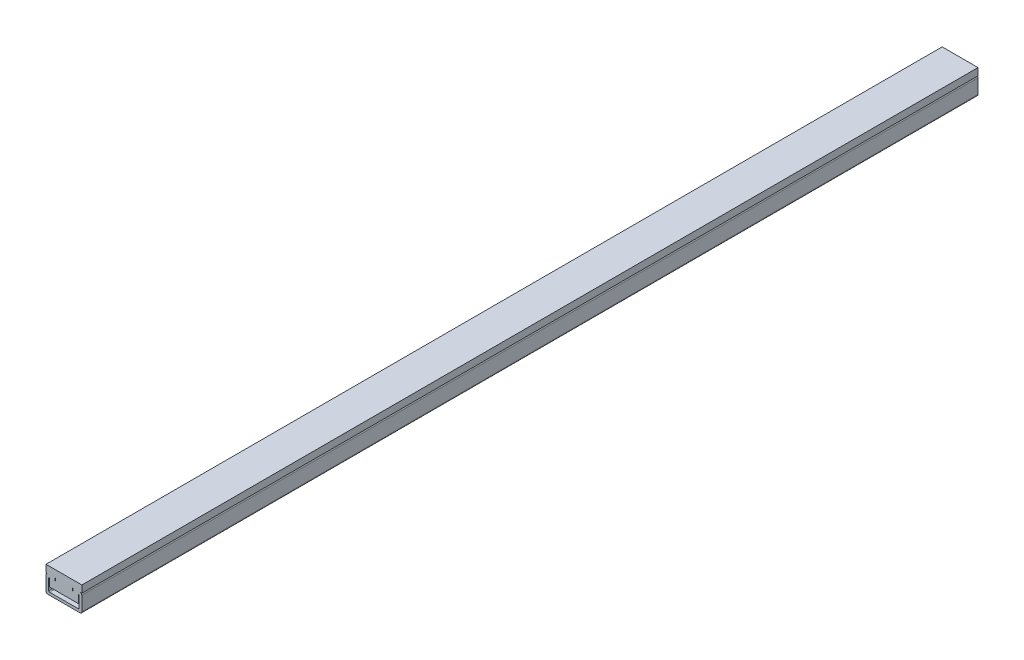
ISO-10303-21;
HEADER;
FILE_DESCRIPTION(('STEP AP214'),'2;1');
FILE_NAME('part.step','',(''),(''),'','','');
FILE_SCHEMA(('AUTOMOTIVE_DESIGN { 1 0 10303 214 1 1 1 1 }'));
ENDSEC;
DATA;
#1=APPLICATION_CONTEXT('core data for automotive mechanical design processes');
#2=APPLICATION_PROTOCOL_DEFINITION('international standard','automotive_design',2000,#1);
#3=PRODUCT_CONTEXT('',#1,'mechanical');
#4=PRODUCT('Part','Part','',(#3));
#5=PRODUCT_RELATED_PRODUCT_CATEGORY('part','',(#4));
#6=PRODUCT_DEFINITION_FORMATION('','',#4);
#7=PRODUCT_DEFINITION_CONTEXT('part definition',#1,'design');
#8=PRODUCT_DEFINITION('design','',#6,#7);
#9=PRODUCT_DEFINITION_SHAPE('','',#8);
#10=(LENGTH_UNIT() NAMED_UNIT(*) SI_UNIT(.MILLI.,.METRE.));
#11=(NAMED_UNIT(*) PLANE_ANGLE_UNIT() SI_UNIT($,.RADIAN.));
#12=(NAMED_UNIT(*) SI_UNIT($,.STERADIAN.) SOLID_ANGLE_UNIT());
#13=UNCERTAINTY_MEASURE_WITH_UNIT(LENGTH_MEASURE(1.E-05),#10,'distance_accuracy_value','');
#14=(GEOMETRIC_REPRESENTATION_CONTEXT(3) GLOBAL_UNCERTAINTY_ASSIGNED_CONTEXT((#13)) GLOBAL_UNIT_ASSIGNED_CONTEXT((#10,
#11,#12)) REPRESENTATION_CONTEXT('',''));
#15=CARTESIAN_POINT('',(0.,0.,0.));
#16=DIRECTION('',(0.,0.,1.));
#17=DIRECTION('',(1.,0.,0.));
#18=AXIS2_PLACEMENT_3D('',#15,#16,#17);
#19=CARTESIAN_POINT('',(9.,1.,0.));
#20=DIRECTION('',(0.,0.,1.));
#21=DIRECTION('',(1.,0.,0.));
#22=AXIS2_PLACEMENT_3D('',#19,#20,#21);
#23=PLANE('',#22);
#24=DIRECTION('',(0.,-1.,0.));
#25=VECTOR('',#24,1.);
#26=CARTESIAN_POINT('',(-4.75,10.,0.));
#27=LINE('',#26,#25);
#28=CARTESIAN_POINT('',(-4.75,10.,0.));
#29=VERTEX_POINT('',#28);
#30=CARTESIAN_POINT('',(-4.75,8.50000000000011,0.));
#31=VERTEX_POINT('',#30);
#32=EDGE_CURVE('E239',#29,#31,#27,.T.);
#33=ORIENTED_EDGE('',*,*,#32,.F.);
#34=DIRECTION('',(-1.,0.,0.));
#35=VECTOR('',#34,1.);
#36=CARTESIAN_POINT('',(-4.75,10.,0.));
#37=LINE('',#36,#35);
#38=CARTESIAN_POINT('',(-5.,10.,0.));
#39=VERTEX_POINT('',#38);
#40=EDGE_CURVE('E230',#29,#39,#37,.T.);
#41=ORIENTED_EDGE('',*,*,#40,.T.);
#42=DIRECTION('',(0.,-1.,0.));
#43=VECTOR('',#42,1.);
#44=CARTESIAN_POINT('',(-5.,10.,0.));
#45=LINE('',#44,#43);
#46=CARTESIAN_POINT('',(-5.,8.50000000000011,0.));
#47=VERTEX_POINT('',#46);
#48=EDGE_CURVE('E236',#39,#47,#45,.T.);
#49=ORIENTED_EDGE('',*,*,#48,.T.);
#50=DIRECTION('',(-1.,0.,0.));
#51=VECTOR('',#50,1.);
#52=CARTESIAN_POINT('',(-4.75,8.50000000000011,0.));
#53=LINE('',#52,#51);
#54=EDGE_CURVE('E29',#31,#47,#53,.T.);
#55=ORIENTED_EDGE('',*,*,#54,.F.);
#56=EDGE_LOOP('',(#33,#41,#49,#55));
#57=FACE_BOUND('',#56,.T.);
#58=DIRECTION('',(-1.,0.,0.));
#59=VECTOR('',#58,1.);
#60=CARTESIAN_POINT('',(5.,10.,0.));
#61=LINE('',#60,#59);
#62=CARTESIAN_POINT('',(5.,10.,0.));
#63=VERTEX_POINT('',#62);
#64=CARTESIAN_POINT('',(4.75,10.,0.));
#65=VERTEX_POINT('',#64);
#66=EDGE_CURVE('E265',#63,#65,#61,.T.);
#67=ORIENTED_EDGE('',*,*,#66,.T.);
#68=DIRECTION('',(0.,-1.,0.));
#69=VECTOR('',#68,1.);
#70=CARTESIAN_POINT('',(4.75,10.,0.));
#71=LINE('',#70,#69);
#72=CARTESIAN_POINT('',(4.75,8.50000000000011,0.));
#73=VERTEX_POINT('',#72);
#74=EDGE_CURVE('E257',#65,#73,#71,.T.);
#75=ORIENTED_EDGE('',*,*,#74,.T.);
#76=DIRECTION('',(-1.,0.,0.));
#77=VECTOR('',#76,1.);
#78=CARTESIAN_POINT('',(5.,8.50000000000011,0.));
#79=LINE('',#78,#77);
#80=CARTESIAN_POINT('',(5.,8.50000000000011,0.));
#81=VERTEX_POINT('',#80);
#82=EDGE_CURVE('E260',#81,#73,#79,.T.);
#83=ORIENTED_EDGE('',*,*,#82,.F.);
#84=DIRECTION('',(0.,-1.,0.));
#85=VECTOR('',#84,1.);
#86=CARTESIAN_POINT('',(5.,10.,0.));
#87=LINE('',#86,#85);
#88=EDGE_CURVE('E263',#63,#81,#87,.T.);
#89=ORIENTED_EDGE('',*,*,#88,.F.);
#90=EDGE_LOOP('',(#67,#75,#83,#89));
#91=FACE_BOUND('',#90,.T.);
#92=CARTESIAN_POINT('',(9.,1.,0.));
#93=DIRECTION('',(0.,0.,1.));
#94=DIRECTION('',(1.,0.,0.));
#95=AXIS2_PLACEMENT_3D('',#92,#93,#94);
#96=CIRCLE('',#95,1.);
#97=CARTESIAN_POINT('',(9.,0.,0.));
#98=VERTEX_POINT('',#97);
#99=CARTESIAN_POINT('',(10.,1.,0.));
#100=VERTEX_POINT('',#99);
#101=EDGE_CURVE('E394',#98,#100,#96,.T.);
#102=ORIENTED_EDGE('',*,*,#101,.F.);
#103=DIRECTION('',(-1.,0.,0.));
#104=VECTOR('',#103,1.);
#105=CARTESIAN_POINT('',(9.,0.,0.));
#106=LINE('',#105,#104);
#107=CARTESIAN_POINT('',(-9.,0.,0.));
#108=VERTEX_POINT('',#107);
#109=EDGE_CURVE('E427',#98,#108,#106,.T.);
#110=ORIENTED_EDGE('',*,*,#109,.T.);
#111=CARTESIAN_POINT('',(-9.,1.,0.));
#112=DIRECTION('',(0.,0.,1.));
#113=DIRECTION('',(1.,0.,0.));
#114=AXIS2_PLACEMENT_3D('',#111,#112,#113);
#115=CIRCLE('',#114,1.);
#116=CARTESIAN_POINT('',(-10.,1.,0.));
#117=VERTEX_POINT('',#116);
#118=EDGE_CURVE('E424',#117,#108,#115,.T.);
#119=ORIENTED_EDGE('',*,*,#118,.F.);
#120=DIRECTION('',(0.,-1.,0.));
#121=VECTOR('',#120,1.);
#122=CARTESIAN_POINT('',(-10.,9.00000000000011,0.));
#123=LINE('',#122,#121);
#124=CARTESIAN_POINT('',(-10.,9.00000000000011,0.));
#125=VERTEX_POINT('',#124);
#126=EDGE_CURVE('E421',#125,#117,#123,.T.);
#127=ORIENTED_EDGE('',*,*,#126,.F.);
#128=CARTESIAN_POINT('',(-9.,9.00000000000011,0.));
#129=DIRECTION('',(0.,0.,1.));
#130=DIRECTION('',(1.,0.,0.));
#131=AXIS2_PLACEMENT_3D('',#128,#129,#130);
#132=CIRCLE('',#131,1.);
#133=CARTESIAN_POINT('',(-9.,10.,0.));
#134=VERTEX_POINT('',#133);
#135=EDGE_CURVE('E418',#134,#125,#132,.T.);
#136=ORIENTED_EDGE('',*,*,#135,.F.);
#137=DIRECTION('',(-1.,0.,0.));
#138=VECTOR('',#137,1.);
#139=CARTESIAN_POINT('',(-9.,10.,0.));
#140=LINE('',#139,#138);
#141=CARTESIAN_POINT('',(-10.,10.,0.));
#142=VERTEX_POINT('',#141);
#143=EDGE_CURVE('E415',#134,#142,#140,.T.);
#144=ORIENTED_EDGE('',*,*,#143,.T.);
#145=DIRECTION('',(0.,1.,0.));
#146=VECTOR('',#145,1.);
#147=CARTESIAN_POINT('',(-10.,10.,0.));
#148=LINE('',#147,#146);
#149=CARTESIAN_POINT('',(-10.,14.,0.));
#150=VERTEX_POINT('',#149);
#151=EDGE_CURVE('E412',#142,#150,#148,.T.);
#152=ORIENTED_EDGE('',*,*,#151,.T.);
#153=DIRECTION('',(1.,0.,0.));
#154=VECTOR('',#153,1.);
#155=CARTESIAN_POINT('',(-10.,14.,0.));
#156=LINE('',#155,#154);
#157=CARTESIAN_POINT('',(10.,14.,0.));
#158=VERTEX_POINT('',#157);
#159=EDGE_CURVE('E409',#150,#158,#156,.T.);
#160=ORIENTED_EDGE('',*,*,#159,.T.);
#161=DIRECTION('',(0.,-1.,0.));
#162=VECTOR('',#161,1.);
#163=CARTESIAN_POINT('',(10.,14.,0.));
#164=LINE('',#163,#162);
#165=CARTESIAN_POINT('',(10.,10.,0.));
#166=VERTEX_POINT('',#165);
#167=EDGE_CURVE('E406',#158,#166,#164,.T.);
#168=ORIENTED_EDGE('',*,*,#167,.T.);
#169=DIRECTION('',(-1.,0.,0.));
#170=VECTOR('',#169,1.);
#171=CARTESIAN_POINT('',(10.,10.,0.));
#172=LINE('',#171,#170);
#173=CARTESIAN_POINT('',(9.,10.,0.));
#174=VERTEX_POINT('',#173);
#175=EDGE_CURVE('E403',#166,#174,#172,.T.);
#176=ORIENTED_EDGE('',*,*,#175,.T.);
#177=CARTESIAN_POINT('',(9.,9.00000000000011,0.));
#178=DIRECTION('',(0.,0.,1.));
#179=DIRECTION('',(1.,0.,0.));
#180=AXIS2_PLACEMENT_3D('',#177,#178,#179);
#181=CIRCLE('',#180,1.);
#182=CARTESIAN_POINT('',(10.,9.00000000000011,0.));
#183=VERTEX_POINT('',#182);
#184=EDGE_CURVE('E400',#183,#174,#181,.T.);
#185=ORIENTED_EDGE('',*,*,#184,.F.);
#186=DIRECTION('',(0.,-1.,0.));
#187=VECTOR('',#186,1.);
#188=CARTESIAN_POINT('',(10.,9.00000000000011,0.));
#189=LINE('',#188,#187);
#190=EDGE_CURVE('E397',#183,#100,#189,.T.);
#191=ORIENTED_EDGE('',*,*,#190,.T.);
#192=EDGE_LOOP('',(#102,#110,#119,#127,#136,#144,#152,#160,#168,#176,#185,#191));
#193=FACE_BOUND('',#192,.T.);
#194=DIRECTION('',(0.,1.,0.));
#195=VECTOR('',#194,1.);
#196=CARTESIAN_POINT('',(8.,4.00000000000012,0.));
#197=LINE('',#196,#195);
#198=CARTESIAN_POINT('',(8.,4.00000000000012,0.));
#199=VERTEX_POINT('',#198);
#200=CARTESIAN_POINT('',(8.,8.50000000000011,0.));
#201=VERTEX_POINT('',#200);
#202=EDGE_CURVE('E307',#199,#201,#197,.T.);
#203=ORIENTED_EDGE('',*,*,#202,.F.);
#204=DIRECTION('',(-1.,0.,0.));
#205=VECTOR('',#204,1.);
#206=CARTESIAN_POINT('',(8.,4.00000000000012,0.));
#207=LINE('',#206,#205);
#208=CARTESIAN_POINT('',(-8.,4.00000000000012,0.));
#209=VERTEX_POINT('',#208);
#210=EDGE_CURVE('E334',#199,#209,#207,.T.);
#211=ORIENTED_EDGE('',*,*,#210,.T.);
#212=DIRECTION('',(0.,1.,0.));
#213=VECTOR('',#212,1.);
#214=CARTESIAN_POINT('',(-8.,4.00000000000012,0.));
#215=LINE('',#214,#213);
#216=CARTESIAN_POINT('',(-8.,8.50000000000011,0.));
#217=VERTEX_POINT('',#216);
#218=EDGE_CURVE('E331',#209,#217,#215,.T.);
#219=ORIENTED_EDGE('',*,*,#218,.T.);
#220=CARTESIAN_POINT('',(-8.,8.0000000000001,0.));
#221=DIRECTION('',(0.,0.,1.));
#222=DIRECTION('',(1.,0.,0.));
#223=AXIS2_PLACEMENT_3D('',#220,#221,#222);
#224=CIRCLE('',#223,0.5);
#225=CARTESIAN_POINT('',(-8.5,8.0000000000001,0.));
#226=VERTEX_POINT('',#225);
#227=EDGE_CURVE('E328',#217,#226,#224,.T.);
#228=ORIENTED_EDGE('',*,*,#227,.T.);
#229=DIRECTION('',(0.,-1.,0.));
#230=VECTOR('',#229,1.);
#231=CARTESIAN_POINT('',(-8.5,8.0000000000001,0.));
#232=LINE('',#231,#230);
#233=CARTESIAN_POINT('',(-8.5,2.00000000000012,0.));
#234=VERTEX_POINT('',#233);
#235=EDGE_CURVE('E325',#226,#234,#232,.T.);
#236=ORIENTED_EDGE('',*,*,#235,.T.);
#237=CARTESIAN_POINT('',(-8.,2.00000000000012,0.));
#238=DIRECTION('',(0.,0.,1.));
#239=DIRECTION('',(1.,0.,0.));
#240=AXIS2_PLACEMENT_3D('',#237,#238,#239);
#241=CIRCLE('',#240,0.5);
#242=CARTESIAN_POINT('',(-8.,1.50000000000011,0.));
#243=VERTEX_POINT('',#242);
#244=EDGE_CURVE('E322',#234,#243,#241,.T.);
#245=ORIENTED_EDGE('',*,*,#244,.T.);
#246=DIRECTION('',(-1.,0.,0.));
#247=VECTOR('',#246,1.);
#248=CARTESIAN_POINT('',(8.,1.50000000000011,0.));
#249=LINE('',#248,#247);
#250=CARTESIAN_POINT('',(8.,1.50000000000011,0.));
#251=VERTEX_POINT('',#250);
#252=EDGE_CURVE('E319',#251,#243,#249,.T.);
#253=ORIENTED_EDGE('',*,*,#252,.F.);
#254=CARTESIAN_POINT('',(8.,2.00000000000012,0.));
#255=DIRECTION('',(0.,0.,1.));
#256=DIRECTION('',(1.,0.,0.));
#257=AXIS2_PLACEMENT_3D('',#254,#255,#256);
#258=CIRCLE('',#257,0.5);
#259=CARTESIAN_POINT('',(8.5,2.00000000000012,0.));
#260=VERTEX_POINT('',#259);
#261=EDGE_CURVE('E316',#251,#260,#258,.T.);
#262=ORIENTED_EDGE('',*,*,#261,.T.);
#263=DIRECTION('',(0.,-1.,0.));
#264=VECTOR('',#263,1.);
#265=CARTESIAN_POINT('',(8.5,8.0000000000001,0.));
#266=LINE('',#265,#264);
#267=CARTESIAN_POINT('',(8.5,8.0000000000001,0.));
#268=VERTEX_POINT('',#267);
#269=EDGE_CURVE('E313',#268,#260,#266,.T.);
#270=ORIENTED_EDGE('',*,*,#269,.F.);
#271=CARTESIAN_POINT('',(8.,8.0000000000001,0.));
#272=DIRECTION('',(0.,0.,1.));
#273=DIRECTION('',(1.,0.,0.));
#274=AXIS2_PLACEMENT_3D('',#271,#272,#273);
#275=CIRCLE('',#274,0.5);
#276=EDGE_CURVE('E310',#268,#201,#275,.T.);
#277=ORIENTED_EDGE('',*,*,#276,.T.);
#278=EDGE_LOOP('',(#203,#211,#219,#228,#236,#245,#253,#262,#270,#277));
#279=FACE_BOUND('',#278,.T.);
#280=ADVANCED_FACE('F14',(#57,#91,#193,#279),#23,.F.);
#281=CARTESIAN_POINT('',(9.,1.,500.));
#282=DIRECTION('',(0.,0.,1.));
#283=DIRECTION('',(1.,0.,0.));
#284=AXIS2_PLACEMENT_3D('',#281,#282,#283);
#285=PLANE('',#284);
#286=DIRECTION('',(-1.,0.,0.));
#287=VECTOR('',#286,1.);
#288=CARTESIAN_POINT('',(-4.75,10.,500.));
#289=LINE('',#288,#287);
#290=CARTESIAN_POINT('',(-4.75,10.,500.));
#291=VERTEX_POINT('',#290);
#292=CARTESIAN_POINT('',(-5.,10.,500.));
#293=VERTEX_POINT('',#292);
#294=EDGE_CURVE('E37',#291,#293,#289,.T.);
#295=ORIENTED_EDGE('',*,*,#294,.F.);
#296=DIRECTION('',(0.,-1.,0.));
#297=VECTOR('',#296,1.);
#298=CARTESIAN_POINT('',(-4.75,10.,500.));
#299=LINE('',#298,#297);
#300=CARTESIAN_POINT('',(-4.75,8.50000000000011,500.));
#301=VERTEX_POINT('',#300);
#302=EDGE_CURVE('E228',#291,#301,#299,.T.);
#303=ORIENTED_EDGE('',*,*,#302,.T.);
#304=DIRECTION('',(-1.,0.,0.));
#305=VECTOR('',#304,1.);
#306=CARTESIAN_POINT('',(-4.75,8.50000000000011,500.));
#307=LINE('',#306,#305);
#308=CARTESIAN_POINT('',(-5.,8.50000000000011,500.));
#309=VERTEX_POINT('',#308);
#310=EDGE_CURVE('E212',#301,#309,#307,.T.);
#311=ORIENTED_EDGE('',*,*,#310,.T.);
#312=DIRECTION('',(0.,-1.,0.));
#313=VECTOR('',#312,1.);
#314=CARTESIAN_POINT('',(-5.,10.,500.));
#315=LINE('',#314,#313);
#316=EDGE_CURVE('E221',#293,#309,#315,.T.);
#317=ORIENTED_EDGE('',*,*,#316,.F.);
#318=EDGE_LOOP('',(#295,#303,#311,#317));
#319=FACE_BOUND('',#318,.T.);
#320=DIRECTION('',(0.,-1.,0.));
#321=VECTOR('',#320,1.);
#322=CARTESIAN_POINT('',(4.75,10.,500.));
#323=LINE('',#322,#321);
#324=CARTESIAN_POINT('',(4.75,10.,500.));
#325=VERTEX_POINT('',#324);
#326=CARTESIAN_POINT('',(4.75,8.50000000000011,500.));
#327=VERTEX_POINT('',#326);
#328=EDGE_CURVE('E246',#325,#327,#323,.T.);
#329=ORIENTED_EDGE('',*,*,#328,.F.);
#330=DIRECTION('',(-1.,0.,0.));
#331=VECTOR('',#330,1.);
#332=CARTESIAN_POINT('',(5.,10.,500.));
#333=LINE('',#332,#331);
#334=CARTESIAN_POINT('',(5.,10.,500.));
#335=VERTEX_POINT('',#334);
#336=EDGE_CURVE('E254',#335,#325,#333,.T.);
#337=ORIENTED_EDGE('',*,*,#336,.F.);
#338=DIRECTION('',(0.,-1.,0.));
#339=VECTOR('',#338,1.);
#340=CARTESIAN_POINT('',(5.,10.,500.));
#341=LINE('',#340,#339);
#342=CARTESIAN_POINT('',(5.,8.50000000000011,500.));
#343=VERTEX_POINT('',#342);
#344=EDGE_CURVE('E251',#335,#343,#341,.T.);
#345=ORIENTED_EDGE('',*,*,#344,.T.);
#346=DIRECTION('',(-1.,0.,0.));
#347=VECTOR('',#346,1.);
#348=CARTESIAN_POINT('',(5.,8.50000000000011,500.));
#349=LINE('',#348,#347);
#350=EDGE_CURVE('E248',#343,#327,#349,.T.);
#351=ORIENTED_EDGE('',*,*,#350,.T.);
#352=EDGE_LOOP('',(#329,#337,#345,#351));
#353=FACE_BOUND('',#352,.T.);
#354=CARTESIAN_POINT('',(9.,1.,500.));
#355=DIRECTION('',(0.,0.,1.));
#356=DIRECTION('',(1.,0.,0.));
#357=AXIS2_PLACEMENT_3D('',#354,#355,#356);
#358=CIRCLE('',#357,1.);
#359=CARTESIAN_POINT('',(9.,0.,500.));
#360=VERTEX_POINT('',#359);
#361=CARTESIAN_POINT('',(10.,1.,500.));
#362=VERTEX_POINT('',#361);
#363=EDGE_CURVE('E358',#360,#362,#358,.T.);
#364=ORIENTED_EDGE('',*,*,#363,.T.);
#365=DIRECTION('',(0.,-1.,0.));
#366=VECTOR('',#365,1.);
#367=CARTESIAN_POINT('',(10.,9.00000000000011,500.));
#368=LINE('',#367,#366);
#369=CARTESIAN_POINT('',(10.,9.00000000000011,500.));
#370=VERTEX_POINT('',#369);
#371=EDGE_CURVE('E361',#370,#362,#368,.T.);
#372=ORIENTED_EDGE('',*,*,#371,.F.);
#373=CARTESIAN_POINT('',(9.,9.00000000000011,500.));
#374=DIRECTION('',(0.,0.,1.));
#375=DIRECTION('',(1.,0.,0.));
#376=AXIS2_PLACEMENT_3D('',#373,#374,#375);
#377=CIRCLE('',#376,1.);
#378=CARTESIAN_POINT('',(9.,10.,500.));
#379=VERTEX_POINT('',#378);
#380=EDGE_CURVE('E364',#370,#379,#377,.T.);
#381=ORIENTED_EDGE('',*,*,#380,.T.);
#382=DIRECTION('',(-1.,0.,0.));
#383=VECTOR('',#382,1.);
#384=CARTESIAN_POINT('',(10.,10.,500.));
#385=LINE('',#384,#383);
#386=CARTESIAN_POINT('',(10.,10.,500.));
#387=VERTEX_POINT('',#386);
#388=EDGE_CURVE('E367',#387,#379,#385,.T.);
#389=ORIENTED_EDGE('',*,*,#388,.F.);
#390=DIRECTION('',(0.,-1.,0.));
#391=VECTOR('',#390,1.);
#392=CARTESIAN_POINT('',(10.,14.,500.));
#393=LINE('',#392,#391);
#394=CARTESIAN_POINT('',(10.,14.,500.));
#395=VERTEX_POINT('',#394);
#396=EDGE_CURVE('E370',#395,#387,#393,.T.);
#397=ORIENTED_EDGE('',*,*,#396,.F.);
#398=DIRECTION('',(1.,0.,0.));
#399=VECTOR('',#398,1.);
#400=CARTESIAN_POINT('',(-10.,14.,500.));
#401=LINE('',#400,#399);
#402=CARTESIAN_POINT('',(-10.,14.,500.));
#403=VERTEX_POINT('',#402);
#404=EDGE_CURVE('E373',#403,#395,#401,.T.);
#405=ORIENTED_EDGE('',*,*,#404,.F.);
#406=DIRECTION('',(0.,1.,0.));
#407=VECTOR('',#406,1.);
#408=CARTESIAN_POINT('',(-10.,10.,500.));
#409=LINE('',#408,#407);
#410=CARTESIAN_POINT('',(-10.,10.,500.));
#411=VERTEX_POINT('',#410);
#412=EDGE_CURVE('E376',#411,#403,#409,.T.);
#413=ORIENTED_EDGE('',*,*,#412,.F.);
#414=DIRECTION('',(-1.,0.,0.));
#415=VECTOR('',#414,1.);
#416=CARTESIAN_POINT('',(-9.,10.,500.));
#417=LINE('',#416,#415);
#418=CARTESIAN_POINT('',(-9.,10.,500.));
#419=VERTEX_POINT('',#418);
#420=EDGE_CURVE('E379',#419,#411,#417,.T.);
#421=ORIENTED_EDGE('',*,*,#420,.F.);
#422=CARTESIAN_POINT('',(-9.,9.00000000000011,500.));
#423=DIRECTION('',(0.,0.,1.));
#424=DIRECTION('',(1.,0.,0.));
#425=AXIS2_PLACEMENT_3D('',#422,#423,#424);
#426=CIRCLE('',#425,1.);
#427=CARTESIAN_POINT('',(-10.,9.00000000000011,500.));
#428=VERTEX_POINT('',#427);
#429=EDGE_CURVE('E382',#419,#428,#426,.T.);
#430=ORIENTED_EDGE('',*,*,#429,.T.);
#431=DIRECTION('',(0.,-1.,0.));
#432=VECTOR('',#431,1.);
#433=CARTESIAN_POINT('',(-10.,9.00000000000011,500.));
#434=LINE('',#433,#432);
#435=CARTESIAN_POINT('',(-10.,1.,500.));
#436=VERTEX_POINT('',#435);
#437=EDGE_CURVE('E385',#428,#436,#434,.T.);
#438=ORIENTED_EDGE('',*,*,#437,.T.);
#439=CARTESIAN_POINT('',(-9.,1.,500.));
#440=DIRECTION('',(0.,0.,1.));
#441=DIRECTION('',(1.,0.,0.));
#442=AXIS2_PLACEMENT_3D('',#439,#440,#441);
#443=CIRCLE('',#442,1.);
#444=CARTESIAN_POINT('',(-9.,0.,500.));
#445=VERTEX_POINT('',#444);
#446=EDGE_CURVE('E388',#436,#445,#443,.T.);
#447=ORIENTED_EDGE('',*,*,#446,.T.);
#448=DIRECTION('',(-1.,0.,0.));
#449=VECTOR('',#448,1.);
#450=CARTESIAN_POINT('',(9.,0.,500.));
#451=LINE('',#450,#449);
#452=EDGE_CURVE('E391',#360,#445,#451,.T.);
#453=ORIENTED_EDGE('',*,*,#452,.F.);
#454=EDGE_LOOP('',(#364,#372,#381,#389,#397,#405,#413,#421,#430,#438,#447,#453));
#455=FACE_BOUND('',#454,.T.);
#456=DIRECTION('',(-1.,0.,0.));
#457=VECTOR('',#456,1.);
#458=CARTESIAN_POINT('',(8.,4.00000000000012,500.));
#459=LINE('',#458,#457);
#460=CARTESIAN_POINT('',(8.,4.00000000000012,500.));
#461=VERTEX_POINT('',#460);
#462=CARTESIAN_POINT('',(-8.,4.00000000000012,500.));
#463=VERTEX_POINT('',#462);
#464=EDGE_CURVE('E304',#461,#463,#459,.T.);
#465=ORIENTED_EDGE('',*,*,#464,.F.);
#466=DIRECTION('',(0.,1.,0.));
#467=VECTOR('',#466,1.);
#468=CARTESIAN_POINT('',(8.,4.00000000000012,500.));
#469=LINE('',#468,#467);
#470=CARTESIAN_POINT('',(8.,8.50000000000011,500.));
#471=VERTEX_POINT('',#470);
#472=EDGE_CURVE('E277',#461,#471,#469,.T.);
#473=ORIENTED_EDGE('',*,*,#472,.T.);
#474=CARTESIAN_POINT('',(8.,8.0000000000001,500.));
#475=DIRECTION('',(0.,0.,1.));
#476=DIRECTION('',(1.,0.,0.));
#477=AXIS2_PLACEMENT_3D('',#474,#475,#476);
#478=CIRCLE('',#477,0.5);
#479=CARTESIAN_POINT('',(8.5,8.0000000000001,500.));
#480=VERTEX_POINT('',#479);
#481=EDGE_CURVE('E280',#480,#471,#478,.T.);
#482=ORIENTED_EDGE('',*,*,#481,.F.);
#483=DIRECTION('',(0.,-1.,0.));
#484=VECTOR('',#483,1.);
#485=CARTESIAN_POINT('',(8.5,8.0000000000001,500.));
#486=LINE('',#485,#484);
#487=CARTESIAN_POINT('',(8.5,2.00000000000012,500.));
#488=VERTEX_POINT('',#487);
#489=EDGE_CURVE('E283',#480,#488,#486,.T.);
#490=ORIENTED_EDGE('',*,*,#489,.T.);
#491=CARTESIAN_POINT('',(8.,2.00000000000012,500.));
#492=DIRECTION('',(0.,0.,1.));
#493=DIRECTION('',(1.,0.,0.));
#494=AXIS2_PLACEMENT_3D('',#491,#492,#493);
#495=CIRCLE('',#494,0.5);
#496=CARTESIAN_POINT('',(8.,1.50000000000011,500.));
#497=VERTEX_POINT('',#496);
#498=EDGE_CURVE('E286',#497,#488,#495,.T.);
#499=ORIENTED_EDGE('',*,*,#498,.F.);
#500=DIRECTION('',(-1.,0.,0.));
#501=VECTOR('',#500,1.);
#502=CARTESIAN_POINT('',(8.,1.50000000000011,500.));
#503=LINE('',#502,#501);
#504=CARTESIAN_POINT('',(-8.,1.50000000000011,500.));
#505=VERTEX_POINT('',#504);
#506=EDGE_CURVE('E289',#497,#505,#503,.T.);
#507=ORIENTED_EDGE('',*,*,#506,.T.);
#508=CARTESIAN_POINT('',(-8.,2.00000000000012,500.));
#509=DIRECTION('',(0.,0.,1.));
#510=DIRECTION('',(1.,0.,0.));
#511=AXIS2_PLACEMENT_3D('',#508,#509,#510);
#512=CIRCLE('',#511,0.5);
#513=CARTESIAN_POINT('',(-8.5,2.00000000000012,500.));
#514=VERTEX_POINT('',#513);
#515=EDGE_CURVE('E292',#514,#505,#512,.T.);
#516=ORIENTED_EDGE('',*,*,#515,.F.);
#517=DIRECTION('',(0.,-1.,0.));
#518=VECTOR('',#517,1.);
#519=CARTESIAN_POINT('',(-8.5,8.0000000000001,500.));
#520=LINE('',#519,#518);
#521=CARTESIAN_POINT('',(-8.5,8.0000000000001,500.));
#522=VERTEX_POINT('',#521);
#523=EDGE_CURVE('E295',#522,#514,#520,.T.);
#524=ORIENTED_EDGE('',*,*,#523,.F.);
#525=CARTESIAN_POINT('',(-8.,8.0000000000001,500.));
#526=DIRECTION('',(0.,0.,1.));
#527=DIRECTION('',(1.,0.,0.));
#528=AXIS2_PLACEMENT_3D('',#525,#526,#527);
#529=CIRCLE('',#528,0.5);
#530=CARTESIAN_POINT('',(-8.,8.50000000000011,500.));
#531=VERTEX_POINT('',#530);
#532=EDGE_CURVE('E298',#531,#522,#529,.T.);
#533=ORIENTED_EDGE('',*,*,#532,.F.);
#534=DIRECTION('',(0.,1.,0.));
#535=VECTOR('',#534,1.);
#536=CARTESIAN_POINT('',(-8.,4.00000000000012,500.));
#537=LINE('',#536,#535);
#538=EDGE_CURVE('E301',#463,#531,#537,.T.);
#539=ORIENTED_EDGE('',*,*,#538,.F.);
#540=EDGE_LOOP('',(#465,#473,#482,#490,#499,#507,#516,#524,#533,#539));
#541=FACE_BOUND('',#540,.T.);
#542=ADVANCED_FACE('F225',(#319,#353,#455,#541),#285,.T.);
#543=CARTESIAN_POINT('',(9.,1.,0.));
#544=DIRECTION('',(0.,0.,1.));
#545=DIRECTION('',(1.,0.,0.));
#546=AXIS2_PLACEMENT_3D('',#543,#544,#545);
#547=CYLINDRICAL_SURFACE('',#546,1.);
#548=DIRECTION('',(0.,0.,1.));
#549=VECTOR('',#548,1.);
#550=CARTESIAN_POINT('',(9.,0.,0.));
#551=LINE('',#550,#549);
#552=EDGE_CURVE('E9',#98,#360,#551,.T.);
#553=ORIENTED_EDGE('',*,*,#552,.F.);
#554=ORIENTED_EDGE('',*,*,#101,.T.);
#555=DIRECTION('',(0.,0.,1.));
#556=VECTOR('',#555,1.);
#557=CARTESIAN_POINT('',(10.,1.,0.));
#558=LINE('',#557,#556);
#559=EDGE_CURVE('E430',#100,#362,#558,.T.);
#560=ORIENTED_EDGE('',*,*,#559,.T.);
#561=ORIENTED_EDGE('',*,*,#363,.F.);
#562=EDGE_LOOP('',(#553,#554,#560,#561));
#563=FACE_BOUND('',#562,.T.);
#564=ADVANCED_FACE('F462',(#563),#547,.T.);
#565=CARTESIAN_POINT('',(9.,0.,0.));
#566=DIRECTION('',(0.,1.,0.));
#567=DIRECTION('',(0.,0.,1.));
#568=AXIS2_PLACEMENT_3D('',#565,#566,#567);
#569=PLANE('',#568);
#570=DIRECTION('',(0.,0.,1.));
#571=VECTOR('',#570,1.);
#572=CARTESIAN_POINT('',(-9.,0.,0.));
#573=LINE('',#572,#571);
#574=EDGE_CURVE('E22',#108,#445,#573,.T.);
#575=ORIENTED_EDGE('',*,*,#574,.F.);
#576=ORIENTED_EDGE('',*,*,#109,.F.);
#577=ORIENTED_EDGE('',*,*,#552,.T.);
#578=ORIENTED_EDGE('',*,*,#452,.T.);
#579=EDGE_LOOP('',(#575,#576,#577,#578));
#580=FACE_BOUND('',#579,.T.);
#581=ADVANCED_FACE('F16',(#580),#569,.F.);
#582=CARTESIAN_POINT('',(-9.,1.,0.));
#583=DIRECTION('',(0.,0.,1.));
#584=DIRECTION('',(1.,0.,0.));
#585=AXIS2_PLACEMENT_3D('',#582,#583,#584);
#586=CYLINDRICAL_SURFACE('',#585,1.);
#587=DIRECTION('',(0.,0.,1.));
#588=VECTOR('',#587,1.);
#589=CARTESIAN_POINT('',(-10.,1.,0.));
#590=LINE('',#589,#588);
#591=EDGE_CURVE('E448',#117,#436,#590,.T.);
#592=ORIENTED_EDGE('',*,*,#591,.F.);
#593=ORIENTED_EDGE('',*,*,#118,.T.);
#594=ORIENTED_EDGE('',*,*,#574,.T.);
#595=ORIENTED_EDGE('',*,*,#446,.F.);
#596=EDGE_LOOP('',(#592,#593,#594,#595));
#597=FACE_BOUND('',#596,.T.);
#598=ADVANCED_FACE('F451',(#597),#586,.T.);
#599=CARTESIAN_POINT('',(-10.,9.00000000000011,0.));
#600=DIRECTION('',(-1.,0.,0.));
#601=DIRECTION('',(0.,0.,1.));
#602=AXIS2_PLACEMENT_3D('',#599,#600,#601);
#603=PLANE('',#602);
#604=DIRECTION('',(0.,0.,1.));
#605=VECTOR('',#604,1.);
#606=CARTESIAN_POINT('',(-10.,9.00000000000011,0.));
#607=LINE('',#606,#605);
#608=EDGE_CURVE('E446',#125,#428,#607,.T.);
#609=ORIENTED_EDGE('',*,*,#608,.F.);
#610=ORIENTED_EDGE('',*,*,#126,.T.);
#611=ORIENTED_EDGE('',*,*,#591,.T.);
#612=ORIENTED_EDGE('',*,*,#437,.F.);
#613=EDGE_LOOP('',(#609,#610,#611,#612));
#614=FACE_BOUND('',#613,.T.);
#615=ADVANCED_FACE('F497',(#614),#603,.T.);
#616=CARTESIAN_POINT('',(-9.,9.00000000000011,0.));
#617=DIRECTION('',(0.,0.,1.));
#618=DIRECTION('',(1.,0.,0.));
#619=AXIS2_PLACEMENT_3D('',#616,#617,#618);
#620=CYLINDRICAL_SURFACE('',#619,1.);
#621=DIRECTION('',(0.,0.,1.));
#622=VECTOR('',#621,1.);
#623=CARTESIAN_POINT('',(-9.,10.,0.));
#624=LINE('',#623,#622);
#625=EDGE_CURVE('E444',#134,#419,#624,.T.);
#626=ORIENTED_EDGE('',*,*,#625,.F.);
#627=ORIENTED_EDGE('',*,*,#135,.T.);
#628=ORIENTED_EDGE('',*,*,#608,.T.);
#629=ORIENTED_EDGE('',*,*,#429,.F.);
#630=EDGE_LOOP('',(#626,#627,#628,#629));
#631=FACE_BOUND('',#630,.T.);
#632=ADVANCED_FACE('F494',(#631),#620,.T.);
#633=CARTESIAN_POINT('',(-9.,10.,0.));
#634=DIRECTION('',(0.,1.,0.));
#635=DIRECTION('',(-1.,0.,0.));
#636=AXIS2_PLACEMENT_3D('',#633,#634,#635);
#637=PLANE('',#636);
#638=DIRECTION('',(0.,0.,1.));
#639=VECTOR('',#638,1.);
#640=CARTESIAN_POINT('',(-10.,10.,0.));
#641=LINE('',#640,#639);
#642=EDGE_CURVE('E442',#142,#411,#641,.T.);
#643=ORIENTED_EDGE('',*,*,#642,.F.);
#644=ORIENTED_EDGE('',*,*,#143,.F.);
#645=ORIENTED_EDGE('',*,*,#625,.T.);
#646=ORIENTED_EDGE('',*,*,#420,.T.);
#647=EDGE_LOOP('',(#643,#644,#645,#646));
#648=FACE_BOUND('',#647,.T.);
#649=ADVANCED_FACE('F490',(#648),#637,.F.);
#650=CARTESIAN_POINT('',(-10.,10.,0.));
#651=DIRECTION('',(1.,0.,0.));
#652=DIRECTION('',(0.,0.,-1.));
#653=AXIS2_PLACEMENT_3D('',#650,#651,#652);
#654=PLANE('',#653);
#655=DIRECTION('',(0.,0.,1.));
#656=VECTOR('',#655,1.);
#657=CARTESIAN_POINT('',(-10.,14.,0.));
#658=LINE('',#657,#656);
#659=EDGE_CURVE('E440',#150,#403,#658,.T.);
#660=ORIENTED_EDGE('',*,*,#659,.F.);
#661=ORIENTED_EDGE('',*,*,#151,.F.);
#662=ORIENTED_EDGE('',*,*,#642,.T.);
#663=ORIENTED_EDGE('',*,*,#412,.T.);
#664=EDGE_LOOP('',(#660,#661,#662,#663));
#665=FACE_BOUND('',#664,.T.);
#666=ADVANCED_FACE('F486',(#665),#654,.F.);
#667=CARTESIAN_POINT('',(-10.,14.,0.));
#668=DIRECTION('',(0.,-1.,0.));
#669=DIRECTION('',(0.,0.,-1.));
#670=AXIS2_PLACEMENT_3D('',#667,#668,#669);
#671=PLANE('',#670);
#672=DIRECTION('',(0.,0.,1.));
#673=VECTOR('',#672,1.);
#674=CARTESIAN_POINT('',(10.,14.,0.));
#675=LINE('',#674,#673);
#676=EDGE_CURVE('E438',#158,#395,#675,.T.);
#677=ORIENTED_EDGE('',*,*,#676,.F.);
#678=ORIENTED_EDGE('',*,*,#159,.F.);
#679=ORIENTED_EDGE('',*,*,#659,.T.);
#680=ORIENTED_EDGE('',*,*,#404,.T.);
#681=EDGE_LOOP('',(#677,#678,#679,#680));
#682=FACE_BOUND('',#681,.T.);
#683=ADVANCED_FACE('F482',(#682),#671,.F.);
#684=CARTESIAN_POINT('',(10.,14.,0.));
#685=DIRECTION('',(-1.,0.,0.));
#686=DIRECTION('',(0.,0.,1.));
#687=AXIS2_PLACEMENT_3D('',#684,#685,#686);
#688=PLANE('',#687);
#689=DIRECTION('',(0.,0.,1.));
#690=VECTOR('',#689,1.);
#691=CARTESIAN_POINT('',(10.,10.,0.));
#692=LINE('',#691,#690);
#693=EDGE_CURVE('E436',#166,#387,#692,.T.);
#694=ORIENTED_EDGE('',*,*,#693,.F.);
#695=ORIENTED_EDGE('',*,*,#167,.F.);
#696=ORIENTED_EDGE('',*,*,#676,.T.);
#697=ORIENTED_EDGE('',*,*,#396,.T.);
#698=EDGE_LOOP('',(#694,#695,#696,#697));
#699=FACE_BOUND('',#698,.T.);
#700=ADVANCED_FACE('F478',(#699),#688,.F.);
#701=CARTESIAN_POINT('',(10.,10.,0.));
#702=DIRECTION('',(0.,1.,0.));
#703=DIRECTION('',(-1.,0.,0.));
#704=AXIS2_PLACEMENT_3D('',#701,#702,#703);
#705=PLANE('',#704);
#706=DIRECTION('',(0.,0.,1.));
#707=VECTOR('',#706,1.);
#708=CARTESIAN_POINT('',(9.,10.,0.));
#709=LINE('',#708,#707);
#710=EDGE_CURVE('E434',#174,#379,#709,.T.);
#711=ORIENTED_EDGE('',*,*,#710,.F.);
#712=ORIENTED_EDGE('',*,*,#175,.F.);
#713=ORIENTED_EDGE('',*,*,#693,.T.);
#714=ORIENTED_EDGE('',*,*,#388,.T.);
#715=EDGE_LOOP('',(#711,#712,#713,#714));
#716=FACE_BOUND('',#715,.T.);
#717=ADVANCED_FACE('F474',(#716),#705,.F.);
#718=CARTESIAN_POINT('',(9.,9.00000000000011,0.));
#719=DIRECTION('',(0.,0.,1.));
#720=DIRECTION('',(1.,0.,0.));
#721=AXIS2_PLACEMENT_3D('',#718,#719,#720);
#722=CYLINDRICAL_SURFACE('',#721,1.);
#723=DIRECTION('',(0.,0.,1.));
#724=VECTOR('',#723,1.);
#725=CARTESIAN_POINT('',(10.,9.00000000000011,0.));
#726=LINE('',#725,#724);
#727=EDGE_CURVE('E432',#183,#370,#726,.T.);
#728=ORIENTED_EDGE('',*,*,#727,.F.);
#729=ORIENTED_EDGE('',*,*,#184,.T.);
#730=ORIENTED_EDGE('',*,*,#710,.T.);
#731=ORIENTED_EDGE('',*,*,#380,.F.);
#732=EDGE_LOOP('',(#728,#729,#730,#731));
#733=FACE_BOUND('',#732,.T.);
#734=ADVANCED_FACE('F470',(#733),#722,.T.);
#735=CARTESIAN_POINT('',(10.,9.00000000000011,0.));
#736=DIRECTION('',(-1.,0.,0.));
#737=DIRECTION('',(0.,0.,1.));
#738=AXIS2_PLACEMENT_3D('',#735,#736,#737);
#739=PLANE('',#738);
#740=ORIENTED_EDGE('',*,*,#190,.F.);
#741=ORIENTED_EDGE('',*,*,#727,.T.);
#742=ORIENTED_EDGE('',*,*,#371,.T.);
#743=ORIENTED_EDGE('',*,*,#559,.F.);
#744=EDGE_LOOP('',(#740,#741,#742,#743));
#745=FACE_BOUND('',#744,.T.);
#746=ADVANCED_FACE('F467',(#745),#739,.F.);
#747=CARTESIAN_POINT('',(8.,4.00000000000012,0.));
#748=DIRECTION('',(1.,0.,0.));
#749=DIRECTION('',(0.,0.,-1.));
#750=AXIS2_PLACEMENT_3D('',#747,#748,#749);
#751=PLANE('',#750);
#752=DIRECTION('',(0.,0.,1.));
#753=VECTOR('',#752,1.);
#754=CARTESIAN_POINT('',(8.,8.50000000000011,0.));
#755=LINE('',#754,#753);
#756=EDGE_CURVE('E356',#201,#471,#755,.T.);
#757=ORIENTED_EDGE('',*,*,#756,.T.);
#758=ORIENTED_EDGE('',*,*,#472,.F.);
#759=DIRECTION('',(0.,0.,1.));
#760=VECTOR('',#759,1.);
#761=CARTESIAN_POINT('',(8.,4.00000000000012,0.));
#762=LINE('',#761,#760);
#763=EDGE_CURVE('E337',#199,#461,#762,.T.);
#764=ORIENTED_EDGE('',*,*,#763,.F.);
#765=ORIENTED_EDGE('',*,*,#202,.T.);
#766=EDGE_LOOP('',(#757,#758,#764,#765));
#767=FACE_BOUND('',#766,.T.);
#768=ADVANCED_FACE('F508',(#767),#751,.T.);
#769=CARTESIAN_POINT('',(8.,8.0000000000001,0.));
#770=DIRECTION('',(0.,0.,1.));
#771=DIRECTION('',(1.,0.,0.));
#772=AXIS2_PLACEMENT_3D('',#769,#770,#771);
#773=CYLINDRICAL_SURFACE('',#772,0.5);
#774=DIRECTION('',(0.,0.,1.));
#775=VECTOR('',#774,1.);
#776=CARTESIAN_POINT('',(8.5,8.0000000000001,0.));
#777=LINE('',#776,#775);
#778=EDGE_CURVE('E354',#268,#480,#777,.T.);
#779=ORIENTED_EDGE('',*,*,#778,.T.);
#780=ORIENTED_EDGE('',*,*,#481,.T.);
#781=ORIENTED_EDGE('',*,*,#756,.F.);
#782=ORIENTED_EDGE('',*,*,#276,.F.);
#783=EDGE_LOOP('',(#779,#780,#781,#782));
#784=FACE_BOUND('',#783,.T.);
#785=ADVANCED_FACE('F541',(#784),#773,.F.);
#786=CARTESIAN_POINT('',(8.5,8.0000000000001,0.));
#787=DIRECTION('',(-1.,0.,0.));
#788=DIRECTION('',(0.,0.,1.));
#789=AXIS2_PLACEMENT_3D('',#786,#787,#788);
#790=PLANE('',#789);
#791=DIRECTION('',(0.,0.,1.));
#792=VECTOR('',#791,1.);
#793=CARTESIAN_POINT('',(8.5,2.00000000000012,0.));
#794=LINE('',#793,#792);
#795=EDGE_CURVE('E352',#260,#488,#794,.T.);
#796=ORIENTED_EDGE('',*,*,#795,.T.);
#797=ORIENTED_EDGE('',*,*,#489,.F.);
#798=ORIENTED_EDGE('',*,*,#778,.F.);
#799=ORIENTED_EDGE('',*,*,#269,.T.);
#800=EDGE_LOOP('',(#796,#797,#798,#799));
#801=FACE_BOUND('',#800,.T.);
#802=ADVANCED_FACE('F538',(#801),#790,.T.);
#803=CARTESIAN_POINT('',(8.,2.00000000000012,0.));
#804=DIRECTION('',(0.,0.,1.));
#805=DIRECTION('',(1.,0.,0.));
#806=AXIS2_PLACEMENT_3D('',#803,#804,#805);
#807=CYLINDRICAL_SURFACE('',#806,0.5);
#808=DIRECTION('',(0.,0.,1.));
#809=VECTOR('',#808,1.);
#810=CARTESIAN_POINT('',(8.,1.50000000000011,0.));
#811=LINE('',#810,#809);
#812=EDGE_CURVE('E350',#251,#497,#811,.T.);
#813=ORIENTED_EDGE('',*,*,#812,.T.);
#814=ORIENTED_EDGE('',*,*,#498,.T.);
#815=ORIENTED_EDGE('',*,*,#795,.F.);
#816=ORIENTED_EDGE('',*,*,#261,.F.);
#817=EDGE_LOOP('',(#813,#814,#815,#816));
#818=FACE_BOUND('',#817,.T.);
#819=ADVANCED_FACE('F535',(#818),#807,.F.);
#820=CARTESIAN_POINT('',(8.,1.50000000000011,0.));
#821=DIRECTION('',(0.,1.,0.));
#822=DIRECTION('',(0.,0.,1.));
#823=AXIS2_PLACEMENT_3D('',#820,#821,#822);
#824=PLANE('',#823);
#825=DIRECTION('',(0.,0.,1.));
#826=VECTOR('',#825,1.);
#827=CARTESIAN_POINT('',(-8.,1.50000000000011,0.));
#828=LINE('',#827,#826);
#829=EDGE_CURVE('E348',#243,#505,#828,.T.);
#830=ORIENTED_EDGE('',*,*,#829,.T.);
#831=ORIENTED_EDGE('',*,*,#506,.F.);
#832=ORIENTED_EDGE('',*,*,#812,.F.);
#833=ORIENTED_EDGE('',*,*,#252,.T.);
#834=EDGE_LOOP('',(#830,#831,#832,#833));
#835=FACE_BOUND('',#834,.T.);
#836=ADVANCED_FACE('F531',(#835),#824,.T.);
#837=CARTESIAN_POINT('',(-8.,2.00000000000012,0.));
#838=DIRECTION('',(0.,0.,1.));
#839=DIRECTION('',(1.,0.,0.));
#840=AXIS2_PLACEMENT_3D('',#837,#838,#839);
#841=CYLINDRICAL_SURFACE('',#840,0.5);
#842=DIRECTION('',(0.,0.,1.));
#843=VECTOR('',#842,1.);
#844=CARTESIAN_POINT('',(-8.5,2.00000000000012,0.));
#845=LINE('',#844,#843);
#846=EDGE_CURVE('E346',#234,#514,#845,.T.);
#847=ORIENTED_EDGE('',*,*,#846,.T.);
#848=ORIENTED_EDGE('',*,*,#515,.T.);
#849=ORIENTED_EDGE('',*,*,#829,.F.);
#850=ORIENTED_EDGE('',*,*,#244,.F.);
#851=EDGE_LOOP('',(#847,#848,#849,#850));
#852=FACE_BOUND('',#851,.T.);
#853=ADVANCED_FACE('F527',(#852),#841,.F.);
#854=CARTESIAN_POINT('',(-8.5,8.0000000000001,0.));
#855=DIRECTION('',(-1.,0.,0.));
#856=DIRECTION('',(0.,0.,1.));
#857=AXIS2_PLACEMENT_3D('',#854,#855,#856);
#858=PLANE('',#857);
#859=DIRECTION('',(0.,0.,1.));
#860=VECTOR('',#859,1.);
#861=CARTESIAN_POINT('',(-8.5,8.0000000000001,0.));
#862=LINE('',#861,#860);
#863=EDGE_CURVE('E344',#226,#522,#862,.T.);
#864=ORIENTED_EDGE('',*,*,#863,.T.);
#865=ORIENTED_EDGE('',*,*,#523,.T.);
#866=ORIENTED_EDGE('',*,*,#846,.F.);
#867=ORIENTED_EDGE('',*,*,#235,.F.);
#868=EDGE_LOOP('',(#864,#865,#866,#867));
#869=FACE_BOUND('',#868,.T.);
#870=ADVANCED_FACE('F523',(#869),#858,.F.);
#871=CARTESIAN_POINT('',(-8.,8.0000000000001,0.));
#872=DIRECTION('',(0.,0.,1.));
#873=DIRECTION('',(1.,0.,0.));
#874=AXIS2_PLACEMENT_3D('',#871,#872,#873);
#875=CYLINDRICAL_SURFACE('',#874,0.5);
#876=DIRECTION('',(0.,0.,1.));
#877=VECTOR('',#876,1.);
#878=CARTESIAN_POINT('',(-8.,8.50000000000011,0.));
#879=LINE('',#878,#877);
#880=EDGE_CURVE('E342',#217,#531,#879,.T.);
#881=ORIENTED_EDGE('',*,*,#880,.T.);
#882=ORIENTED_EDGE('',*,*,#532,.T.);
#883=ORIENTED_EDGE('',*,*,#863,.F.);
#884=ORIENTED_EDGE('',*,*,#227,.F.);
#885=EDGE_LOOP('',(#881,#882,#883,#884));
#886=FACE_BOUND('',#885,.T.);
#887=ADVANCED_FACE('F520',(#886),#875,.F.);
#888=CARTESIAN_POINT('',(-8.,4.00000000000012,0.));
#889=DIRECTION('',(1.,0.,0.));
#890=DIRECTION('',(0.,0.,-1.));
#891=AXIS2_PLACEMENT_3D('',#888,#889,#890);
#892=PLANE('',#891);
#893=DIRECTION('',(0.,0.,1.));
#894=VECTOR('',#893,1.);
#895=CARTESIAN_POINT('',(-8.,4.00000000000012,0.));
#896=LINE('',#895,#894);
#897=EDGE_CURVE('E340',#209,#463,#896,.T.);
#898=ORIENTED_EDGE('',*,*,#897,.T.);
#899=ORIENTED_EDGE('',*,*,#538,.T.);
#900=ORIENTED_EDGE('',*,*,#880,.F.);
#901=ORIENTED_EDGE('',*,*,#218,.F.);
#902=EDGE_LOOP('',(#898,#899,#900,#901));
#903=FACE_BOUND('',#902,.T.);
#904=ADVANCED_FACE('F515',(#903),#892,.F.);
#905=CARTESIAN_POINT('',(8.,4.00000000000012,0.));
#906=DIRECTION('',(0.,1.,0.));
#907=DIRECTION('',(0.,0.,1.));
#908=AXIS2_PLACEMENT_3D('',#905,#906,#907);
#909=PLANE('',#908);
#910=ORIENTED_EDGE('',*,*,#210,.F.);
#911=ORIENTED_EDGE('',*,*,#763,.T.);
#912=ORIENTED_EDGE('',*,*,#464,.T.);
#913=ORIENTED_EDGE('',*,*,#897,.F.);
#914=EDGE_LOOP('',(#910,#911,#912,#913));
#915=FACE_BOUND('',#914,.T.);
#916=ADVANCED_FACE('F512',(#915),#909,.F.);
#917=CARTESIAN_POINT('',(4.75,10.,0.));
#918=DIRECTION('',(-1.,0.,0.));
#919=DIRECTION('',(0.,0.,1.));
#920=AXIS2_PLACEMENT_3D('',#917,#918,#919);
#921=PLANE('',#920);
#922=DIRECTION('',(0.,0.,1.));
#923=VECTOR('',#922,1.);
#924=CARTESIAN_POINT('',(4.75,10.,0.));
#925=LINE('',#924,#923);
#926=EDGE_CURVE('E275',#65,#325,#925,.T.);
#927=ORIENTED_EDGE('',*,*,#926,.T.);
#928=ORIENTED_EDGE('',*,*,#328,.T.);
#929=DIRECTION('',(0.,0.,1.));
#930=VECTOR('',#929,1.);
#931=CARTESIAN_POINT('',(4.75,8.50000000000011,0.));
#932=LINE('',#931,#930);
#933=EDGE_CURVE('E268',#73,#327,#932,.T.);
#934=ORIENTED_EDGE('',*,*,#933,.F.);
#935=ORIENTED_EDGE('',*,*,#74,.F.);
#936=EDGE_LOOP('',(#927,#928,#934,#935));
#937=FACE_BOUND('',#936,.T.);
#938=ADVANCED_FACE('F720',(#937),#921,.F.);
#939=CARTESIAN_POINT('',(5.,10.,0.));
#940=DIRECTION('',(0.,1.,0.));
#941=DIRECTION('',(0.,0.,1.));
#942=AXIS2_PLACEMENT_3D('',#939,#940,#941);
#943=PLANE('',#942);
#944=DIRECTION('',(0.,0.,1.));
#945=VECTOR('',#944,1.);
#946=CARTESIAN_POINT('',(5.,10.,0.));
#947=LINE('',#946,#945);
#948=EDGE_CURVE('E273',#63,#335,#947,.T.);
#949=ORIENTED_EDGE('',*,*,#948,.T.);
#950=ORIENTED_EDGE('',*,*,#336,.T.);
#951=ORIENTED_EDGE('',*,*,#926,.F.);
#952=ORIENTED_EDGE('',*,*,#66,.F.);
#953=EDGE_LOOP('',(#949,#950,#951,#952));
#954=FACE_BOUND('',#953,.T.);
#955=ADVANCED_FACE('F728',(#954),#943,.F.);
#956=CARTESIAN_POINT('',(5.,10.,0.));
#957=DIRECTION('',(-1.,0.,0.));
#958=DIRECTION('',(0.,0.,1.));
#959=AXIS2_PLACEMENT_3D('',#956,#957,#958);
#960=PLANE('',#959);
#961=DIRECTION('',(0.,0.,1.));
#962=VECTOR('',#961,1.);
#963=CARTESIAN_POINT('',(5.,8.50000000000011,0.));
#964=LINE('',#963,#962);
#965=EDGE_CURVE('E271',#81,#343,#964,.T.);
#966=ORIENTED_EDGE('',*,*,#965,.T.);
#967=ORIENTED_EDGE('',*,*,#344,.F.);
#968=ORIENTED_EDGE('',*,*,#948,.F.);
#969=ORIENTED_EDGE('',*,*,#88,.T.);
#970=EDGE_LOOP('',(#966,#967,#968,#969));
#971=FACE_BOUND('',#970,.T.);
#972=ADVANCED_FACE('F737',(#971),#960,.T.);
#973=CARTESIAN_POINT('',(5.,8.50000000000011,0.));
#974=DIRECTION('',(0.,1.,0.));
#975=DIRECTION('',(0.,0.,1.));
#976=AXIS2_PLACEMENT_3D('',#973,#974,#975);
#977=PLANE('',#976);
#978=ORIENTED_EDGE('',*,*,#82,.T.);
#979=ORIENTED_EDGE('',*,*,#933,.T.);
#980=ORIENTED_EDGE('',*,*,#350,.F.);
#981=ORIENTED_EDGE('',*,*,#965,.F.);
#982=EDGE_LOOP('',(#978,#979,#980,#981));
#983=FACE_BOUND('',#982,.T.);
#984=ADVANCED_FACE('F746',(#983),#977,.T.);
#985=CARTESIAN_POINT('',(-4.75,10.,0.));
#986=DIRECTION('',(0.,1.,0.));
#987=DIRECTION('',(0.,0.,1.));
#988=AXIS2_PLACEMENT_3D('',#985,#986,#987);
#989=PLANE('',#988);
#990=DIRECTION('',(0.,0.,1.));
#991=VECTOR('',#990,1.);
#992=CARTESIAN_POINT('',(-4.75,10.,0.));
#993=LINE('',#992,#991);
#994=EDGE_CURVE('E244',#29,#291,#993,.T.);
#995=ORIENTED_EDGE('',*,*,#994,.T.);
#996=ORIENTED_EDGE('',*,*,#294,.T.);
#997=DIRECTION('',(0.,0.,1.));
#998=VECTOR('',#997,1.);
#999=CARTESIAN_POINT('',(-5.,10.,0.));
#1000=LINE('',#999,#998);
#1001=EDGE_CURVE('E218',#39,#293,#1000,.T.);
#1002=ORIENTED_EDGE('',*,*,#1001,.F.);
#1003=ORIENTED_EDGE('',*,*,#40,.F.);
#1004=EDGE_LOOP('',(#995,#996,#1002,#1003));
#1005=FACE_BOUND('',#1004,.T.);
#1006=ADVANCED_FACE('F755',(#1005),#989,.F.);
#1007=CARTESIAN_POINT('',(-4.75,10.,0.));
#1008=DIRECTION('',(-1.,0.,0.));
#1009=DIRECTION('',(0.,0.,1.));
#1010=AXIS2_PLACEMENT_3D('',#1007,#1008,#1009);
#1011=PLANE('',#1010);
#1012=DIRECTION('',(0.,0.,1.));
#1013=VECTOR('',#1012,1.);
#1014=CARTESIAN_POINT('',(-4.75,8.50000000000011,0.));
#1015=LINE('',#1014,#1013);
#1016=EDGE_CURVE('E217',#31,#301,#1015,.T.);
#1017=ORIENTED_EDGE('',*,*,#1016,.T.);
#1018=ORIENTED_EDGE('',*,*,#302,.F.);
#1019=ORIENTED_EDGE('',*,*,#994,.F.);
#1020=ORIENTED_EDGE('',*,*,#32,.T.);
#1021=EDGE_LOOP('',(#1017,#1018,#1019,#1020));
#1022=FACE_BOUND('',#1021,.T.);
#1023=ADVANCED_FACE('F764',(#1022),#1011,.T.);
#1024=CARTESIAN_POINT('',(-4.75,8.50000000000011,0.));
#1025=DIRECTION('',(0.,1.,0.));
#1026=DIRECTION('',(0.,0.,1.));
#1027=AXIS2_PLACEMENT_3D('',#1024,#1025,#1026);
#1028=PLANE('',#1027);
#1029=DIRECTION('',(0.,0.,1.));
#1030=VECTOR('',#1029,1.);
#1031=CARTESIAN_POINT('',(-5.,8.50000000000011,0.));
#1032=LINE('',#1031,#1030);
#1033=EDGE_CURVE('E208',#47,#309,#1032,.T.);
#1034=ORIENTED_EDGE('',*,*,#1033,.T.);
#1035=ORIENTED_EDGE('',*,*,#310,.F.);
#1036=ORIENTED_EDGE('',*,*,#1016,.F.);
#1037=ORIENTED_EDGE('',*,*,#54,.T.);
#1038=EDGE_LOOP('',(#1034,#1035,#1036,#1037));
#1039=FACE_BOUND('',#1038,.T.);
#1040=ADVANCED_FACE('F210',(#1039),#1028,.T.);
#1041=CARTESIAN_POINT('',(-5.,10.,0.));
#1042=DIRECTION('',(-1.,0.,0.));
#1043=DIRECTION('',(0.,0.,1.));
#1044=AXIS2_PLACEMENT_3D('',#1041,#1042,#1043);
#1045=PLANE('',#1044);
#1046=ORIENTED_EDGE('',*,*,#48,.F.);
#1047=ORIENTED_EDGE('',*,*,#1001,.T.);
#1048=ORIENTED_EDGE('',*,*,#316,.T.);
#1049=ORIENTED_EDGE('',*,*,#1033,.F.);
#1050=EDGE_LOOP('',(#1046,#1047,#1048,#1049));
#1051=FACE_BOUND('',#1050,.T.);
#1052=ADVANCED_FACE('F222',(#1051),#1045,.F.);
#1053=CLOSED_SHELL('',(#280,#542,#564,#581,#598,#615,#632,#649,#666,#683,#700,#717,#734,#746,
#768,#785,#802,#819,#836,#853,#870,#887,#904,#916,#938,#955,#972,#984,#1006,#1023,#1040,#1052));
#1054=MANIFOLD_SOLID_BREP('B1',#1053);
#1055=ADVANCED_BREP_SHAPE_REPRESENTATION('',(#18,#1054),#14);
#1056=SHAPE_DEFINITION_REPRESENTATION(#9,#1055);
ENDSEC;
END-ISO-10303-21;
